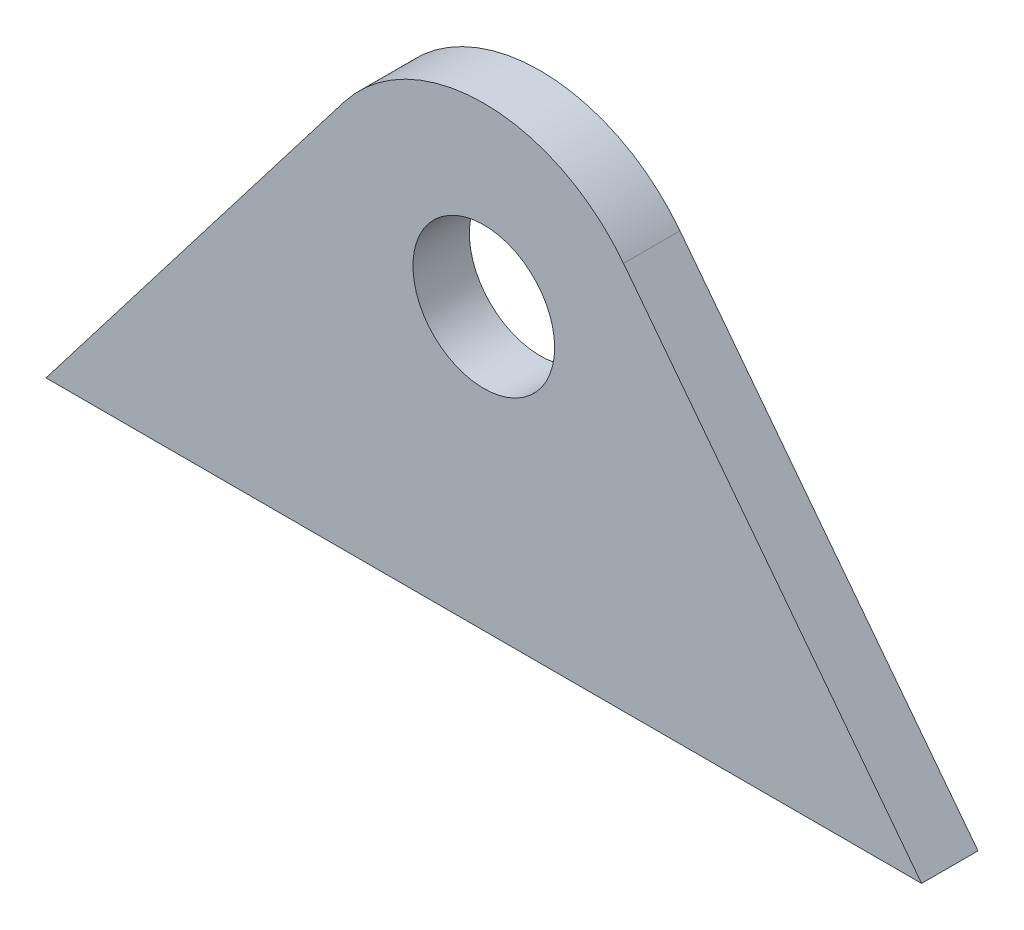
ISO-10303-21;
HEADER;
FILE_DESCRIPTION(('STEP AP214'),'2;1');
FILE_NAME('part.step','',(''),(''),'','','');
FILE_SCHEMA(('AUTOMOTIVE_DESIGN { 1 0 10303 214 1 1 1 1 }'));
ENDSEC;
DATA;
#1=APPLICATION_CONTEXT('core data for automotive mechanical design processes');
#2=APPLICATION_PROTOCOL_DEFINITION('international standard','automotive_design',2000,#1);
#3=PRODUCT_CONTEXT('',#1,'mechanical');
#4=PRODUCT('Part','Part','',(#3));
#5=PRODUCT_RELATED_PRODUCT_CATEGORY('part','',(#4));
#6=PRODUCT_DEFINITION_FORMATION('','',#4);
#7=PRODUCT_DEFINITION_CONTEXT('part definition',#1,'design');
#8=PRODUCT_DEFINITION('design','',#6,#7);
#9=PRODUCT_DEFINITION_SHAPE('','',#8);
#10=(LENGTH_UNIT() NAMED_UNIT(*) SI_UNIT(.MILLI.,.METRE.));
#11=(NAMED_UNIT(*) PLANE_ANGLE_UNIT() SI_UNIT($,.RADIAN.));
#12=(NAMED_UNIT(*) SI_UNIT($,.STERADIAN.) SOLID_ANGLE_UNIT());
#13=UNCERTAINTY_MEASURE_WITH_UNIT(LENGTH_MEASURE(1.E-05),#10,'distance_accuracy_value','');
#14=(GEOMETRIC_REPRESENTATION_CONTEXT(3) GLOBAL_UNCERTAINTY_ASSIGNED_CONTEXT((#13)) GLOBAL_UNIT_ASSIGNED_CONTEXT((#10,
#11,#12)) REPRESENTATION_CONTEXT('',''));
#15=CARTESIAN_POINT('',(0.,0.,0.));
#16=DIRECTION('',(0.,0.,1.));
#17=DIRECTION('',(1.,0.,0.));
#18=AXIS2_PLACEMENT_3D('',#15,#16,#17);
#19=CARTESIAN_POINT('',(0.,0.,8.));
#20=DIRECTION('',(0.,0.,1.));
#21=DIRECTION('',(1.,0.,0.));
#22=AXIS2_PLACEMENT_3D('',#19,#20,#21);
#23=PLANE('',#22);
#24=DIRECTION('',(-0.609201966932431,-0.79301510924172,0.));
#25=VECTOR('',#24,1.);
#26=CARTESIAN_POINT('',(-19.825377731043,15.2300491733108,8.));
#27=LINE('',#26,#25);
#28=CARTESIAN_POINT('',(-19.825377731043,15.2300491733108,8.));
#29=VERTEX_POINT('',#28);
#30=CARTESIAN_POINT('',(-62.1,-39.8,8.));
#31=VERTEX_POINT('',#30);
#32=EDGE_CURVE('E99',#29,#31,#27,.T.);
#33=ORIENTED_EDGE('',*,*,#32,.T.);
#34=DIRECTION('',(1.,0.,0.));
#35=VECTOR('',#34,1.);
#36=CARTESIAN_POINT('',(-62.1,-39.8,8.));
#37=LINE('',#36,#35);
#38=CARTESIAN_POINT('',(62.1,-39.8,8.));
#39=VERTEX_POINT('',#38);
#40=EDGE_CURVE('E84',#31,#39,#37,.T.);
#41=ORIENTED_EDGE('',*,*,#40,.T.);
#42=DIRECTION('',(-0.609201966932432,0.793015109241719,0.));
#43=VECTOR('',#42,1.);
#44=CARTESIAN_POINT('',(62.1,-39.8,8.));
#45=LINE('',#44,#43);
#46=CARTESIAN_POINT('',(19.825377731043,15.2300491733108,8.));
#47=VERTEX_POINT('',#46);
#48=EDGE_CURVE('E50',#39,#47,#45,.T.);
#49=ORIENTED_EDGE('',*,*,#48,.T.);
#50=CARTESIAN_POINT('',(0.,0.,8.));
#51=DIRECTION('',(0.,0.,1.));
#52=DIRECTION('',(1.,0.,0.));
#53=AXIS2_PLACEMENT_3D('',#50,#51,#52);
#54=CIRCLE('',#53,25.);
#55=EDGE_CURVE('E45',#47,#29,#54,.T.);
#56=ORIENTED_EDGE('',*,*,#55,.T.);
#57=EDGE_LOOP('',(#33,#41,#49,#56));
#58=FACE_BOUND('',#57,.T.);
#59=CARTESIAN_POINT('',(0.,0.,8.));
#60=DIRECTION('',(0.,0.,1.));
#61=DIRECTION('',(1.,0.,0.));
#62=AXIS2_PLACEMENT_3D('',#59,#60,#61);
#63=CIRCLE('',#62,10.05);
#64=CARTESIAN_POINT('',(10.05,0.,8.));
#65=VERTEX_POINT('',#64);
#66=EDGE_CURVE('E89',#65,#65,#63,.T.);
#67=ORIENTED_EDGE('',*,*,#66,.F.);
#68=EDGE_LOOP('',(#67));
#69=FACE_BOUND('',#68,.T.);
#70=ADVANCED_FACE('F30',(#58,#69),#23,.T.);
#71=CARTESIAN_POINT('',(0.,0.,0.));
#72=DIRECTION('',(0.,0.,1.));
#73=DIRECTION('',(1.,0.,0.));
#74=AXIS2_PLACEMENT_3D('',#71,#72,#73);
#75=PLANE('',#74);
#76=DIRECTION('',(-0.609201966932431,-0.79301510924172,0.));
#77=VECTOR('',#76,1.);
#78=CARTESIAN_POINT('',(-19.825377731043,15.2300491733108,0.));
#79=LINE('',#78,#77);
#80=CARTESIAN_POINT('',(-19.825377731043,15.2300491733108,0.));
#81=VERTEX_POINT('',#80);
#82=CARTESIAN_POINT('',(-62.1,-39.8,0.));
#83=VERTEX_POINT('',#82);
#84=EDGE_CURVE('E76',#81,#83,#79,.T.);
#85=ORIENTED_EDGE('',*,*,#84,.F.);
#86=CARTESIAN_POINT('',(0.,0.,0.));
#87=DIRECTION('',(0.,0.,1.));
#88=DIRECTION('',(1.,0.,0.));
#89=AXIS2_PLACEMENT_3D('',#86,#87,#88);
#90=CIRCLE('',#89,25.);
#91=CARTESIAN_POINT('',(19.825377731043,15.2300491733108,0.));
#92=VERTEX_POINT('',#91);
#93=EDGE_CURVE('E97',#92,#81,#90,.T.);
#94=ORIENTED_EDGE('',*,*,#93,.F.);
#95=DIRECTION('',(-0.609201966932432,0.793015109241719,0.));
#96=VECTOR('',#95,1.);
#97=CARTESIAN_POINT('',(62.1,-39.8,0.));
#98=LINE('',#97,#96);
#99=CARTESIAN_POINT('',(62.1,-39.8,0.));
#100=VERTEX_POINT('',#99);
#101=EDGE_CURVE('E77',#100,#92,#98,.T.);
#102=ORIENTED_EDGE('',*,*,#101,.F.);
#103=DIRECTION('',(1.,0.,0.));
#104=VECTOR('',#103,1.);
#105=CARTESIAN_POINT('',(-62.1,-39.8,0.));
#106=LINE('',#105,#104);
#107=EDGE_CURVE('E71',#83,#100,#106,.T.);
#108=ORIENTED_EDGE('',*,*,#107,.F.);
#109=EDGE_LOOP('',(#85,#94,#102,#108));
#110=FACE_BOUND('',#109,.T.);
#111=CARTESIAN_POINT('',(0.,0.,0.));
#112=DIRECTION('',(0.,0.,1.));
#113=DIRECTION('',(1.,0.,0.));
#114=AXIS2_PLACEMENT_3D('',#111,#112,#113);
#115=CIRCLE('',#114,10.05);
#116=CARTESIAN_POINT('',(10.05,0.,0.));
#117=VERTEX_POINT('',#116);
#118=EDGE_CURVE('E92',#117,#117,#115,.T.);
#119=ORIENTED_EDGE('',*,*,#118,.T.);
#120=EDGE_LOOP('',(#119));
#121=FACE_BOUND('',#120,.T.);
#122=ADVANCED_FACE('F72',(#110,#121),#75,.F.);
#123=CARTESIAN_POINT('',(-19.825377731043,15.2300491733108,8.));
#124=DIRECTION('',(0.79301510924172,-0.609201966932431,0.));
#125=DIRECTION('',(0.609201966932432,0.79301510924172,0.));
#126=AXIS2_PLACEMENT_3D('',#123,#124,#125);
#127=PLANE('',#126);
#128=ORIENTED_EDGE('',*,*,#84,.T.);
#129=DIRECTION('',(0.,0.,-1.));
#130=VECTOR('',#129,1.);
#131=CARTESIAN_POINT('',(-62.1,-39.8,8.));
#132=LINE('',#131,#130);
#133=EDGE_CURVE('E11',#31,#83,#132,.T.);
#134=ORIENTED_EDGE('',*,*,#133,.F.);
#135=ORIENTED_EDGE('',*,*,#32,.F.);
#136=DIRECTION('',(0.,0.,-1.));
#137=VECTOR('',#136,1.);
#138=CARTESIAN_POINT('',(-19.825377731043,15.2300491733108,8.));
#139=LINE('',#138,#137);
#140=EDGE_CURVE('E88',#29,#81,#139,.T.);
#141=ORIENTED_EDGE('',*,*,#140,.T.);
#142=EDGE_LOOP('',(#128,#134,#135,#141));
#143=FACE_BOUND('',#142,.T.);
#144=ADVANCED_FACE('F32',(#143),#127,.F.);
#145=CARTESIAN_POINT('',(-62.1,-39.8,8.));
#146=DIRECTION('',(0.,1.,0.));
#147=DIRECTION('',(-1.,0.,0.));
#148=AXIS2_PLACEMENT_3D('',#145,#146,#147);
#149=PLANE('',#148);
#150=ORIENTED_EDGE('',*,*,#107,.T.);
#151=DIRECTION('',(0.,0.,-1.));
#152=VECTOR('',#151,1.);
#153=CARTESIAN_POINT('',(62.1,-39.8,8.));
#154=LINE('',#153,#152);
#155=EDGE_CURVE('E38',#39,#100,#154,.T.);
#156=ORIENTED_EDGE('',*,*,#155,.F.);
#157=ORIENTED_EDGE('',*,*,#40,.F.);
#158=ORIENTED_EDGE('',*,*,#133,.T.);
#159=EDGE_LOOP('',(#150,#156,#157,#158));
#160=FACE_BOUND('',#159,.T.);
#161=ADVANCED_FACE('F83',(#160),#149,.F.);
#162=CARTESIAN_POINT('',(62.1,-39.8,8.));
#163=DIRECTION('',(-0.793015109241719,-0.609201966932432,0.));
#164=DIRECTION('',(0.609201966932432,-0.793015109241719,0.));
#165=AXIS2_PLACEMENT_3D('',#162,#163,#164);
#166=PLANE('',#165);
#167=ORIENTED_EDGE('',*,*,#101,.T.);
#168=DIRECTION('',(0.,0.,-1.));
#169=VECTOR('',#168,1.);
#170=CARTESIAN_POINT('',(19.825377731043,15.2300491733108,8.));
#171=LINE('',#170,#169);
#172=EDGE_CURVE('E105',#47,#92,#171,.T.);
#173=ORIENTED_EDGE('',*,*,#172,.F.);
#174=ORIENTED_EDGE('',*,*,#48,.F.);
#175=ORIENTED_EDGE('',*,*,#155,.T.);
#176=EDGE_LOOP('',(#167,#173,#174,#175));
#177=FACE_BOUND('',#176,.T.);
#178=ADVANCED_FACE('F108',(#177),#166,.F.);
#179=CARTESIAN_POINT('',(0.,0.,8.));
#180=DIRECTION('',(0.,0.,-1.));
#181=DIRECTION('',(-1.,0.,0.));
#182=AXIS2_PLACEMENT_3D('',#179,#180,#181);
#183=CYLINDRICAL_SURFACE('',#182,25.);
#184=ORIENTED_EDGE('',*,*,#93,.T.);
#185=ORIENTED_EDGE('',*,*,#140,.F.);
#186=ORIENTED_EDGE('',*,*,#55,.F.);
#187=ORIENTED_EDGE('',*,*,#172,.T.);
#188=EDGE_LOOP('',(#184,#185,#186,#187));
#189=FACE_BOUND('',#188,.T.);
#190=ADVANCED_FACE('F110',(#189),#183,.T.);
#191=CARTESIAN_POINT('',(0.,0.,8.));
#192=DIRECTION('',(0.,0.,-1.));
#193=DIRECTION('',(-1.,0.,0.));
#194=AXIS2_PLACEMENT_3D('',#191,#192,#193);
#195=CYLINDRICAL_SURFACE('',#194,10.05);
#196=ORIENTED_EDGE('',*,*,#66,.T.);
#197=EDGE_LOOP('',(#196));
#198=FACE_BOUND('',#197,.T.);
#199=ORIENTED_EDGE('',*,*,#118,.F.);
#200=EDGE_LOOP('',(#199));
#201=FACE_BOUND('',#200,.T.);
#202=ADVANCED_FACE('F116',(#198,#201),#195,.F.);
#203=CLOSED_SHELL('',(#70,#122,#144,#161,#178,#190,#202));
#204=MANIFOLD_SOLID_BREP('B2',#203);
#205=ADVANCED_BREP_SHAPE_REPRESENTATION('',(#18,#204),#14);
#206=SHAPE_DEFINITION_REPRESENTATION(#9,#205);
ENDSEC;
END-ISO-10303-21;
